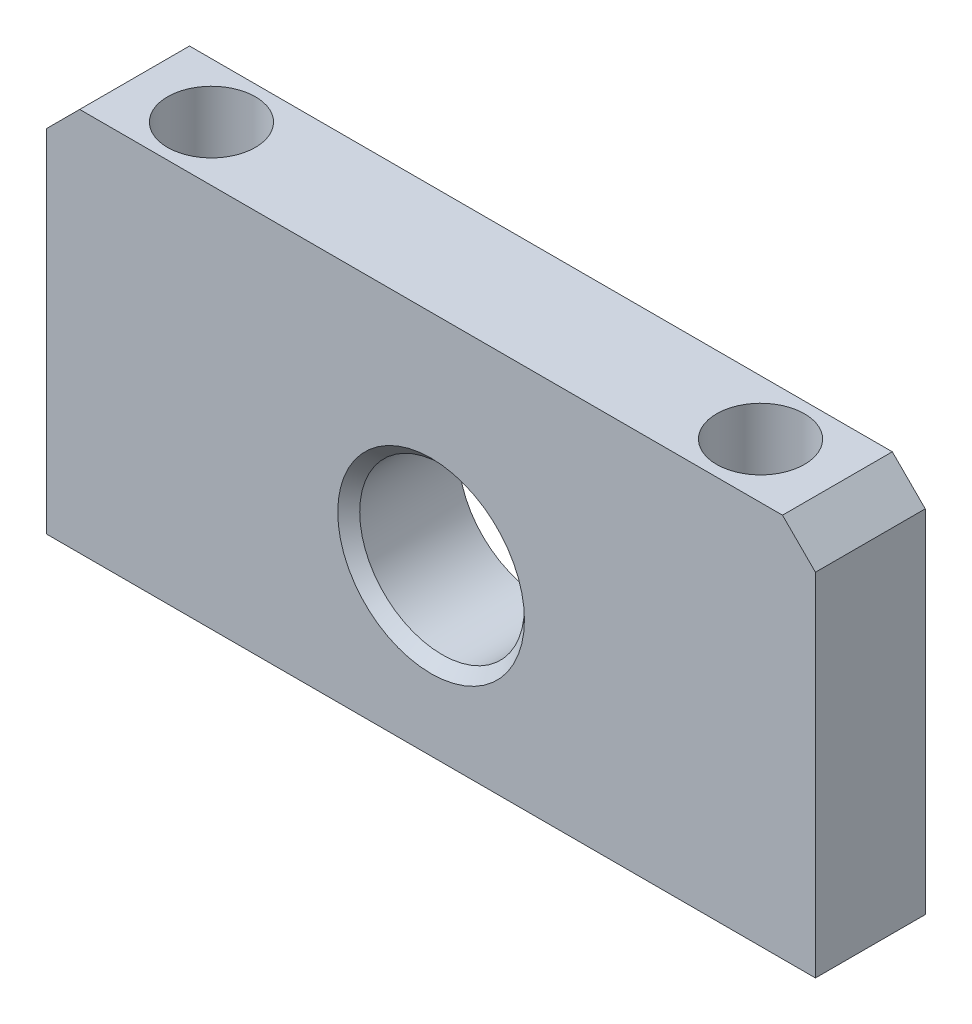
ISO-10303-21;
HEADER;
FILE_DESCRIPTION(('STEP AP214'),'2;1');
FILE_NAME('part.step','',(''),(''),'','','');
FILE_SCHEMA(('AUTOMOTIVE_DESIGN { 1 0 10303 214 1 1 1 1 }'));
ENDSEC;
DATA;
#1=APPLICATION_CONTEXT('core data for automotive mechanical design processes');
#2=APPLICATION_PROTOCOL_DEFINITION('international standard','automotive_design',2000,#1);
#3=PRODUCT_CONTEXT('',#1,'mechanical');
#4=PRODUCT('Part','Part','',(#3));
#5=PRODUCT_RELATED_PRODUCT_CATEGORY('part','',(#4));
#6=PRODUCT_DEFINITION_FORMATION('','',#4);
#7=PRODUCT_DEFINITION_CONTEXT('part definition',#1,'design');
#8=PRODUCT_DEFINITION('design','',#6,#7);
#9=PRODUCT_DEFINITION_SHAPE('','',#8);
#10=(LENGTH_UNIT() NAMED_UNIT(*) SI_UNIT(.MILLI.,.METRE.));
#11=(NAMED_UNIT(*) PLANE_ANGLE_UNIT() SI_UNIT($,.RADIAN.));
#12=(NAMED_UNIT(*) SI_UNIT($,.STERADIAN.) SOLID_ANGLE_UNIT());
#13=UNCERTAINTY_MEASURE_WITH_UNIT(LENGTH_MEASURE(1.E-05),#10,'distance_accuracy_value','');
#14=(GEOMETRIC_REPRESENTATION_CONTEXT(3) GLOBAL_UNCERTAINTY_ASSIGNED_CONTEXT((#13)) GLOBAL_UNIT_ASSIGNED_CONTEXT((#10,
#11,#12)) REPRESENTATION_CONTEXT('',''));
#15=CARTESIAN_POINT('',(0.,0.,0.));
#16=DIRECTION('',(0.,0.,1.));
#17=DIRECTION('',(1.,0.,0.));
#18=AXIS2_PLACEMENT_3D('',#15,#16,#17);
#19=CARTESIAN_POINT('',(0.,0.,10.));
#20=DIRECTION('',(1.,0.,0.));
#21=DIRECTION('',(0.,0.,-1.));
#22=AXIS2_PLACEMENT_3D('',#19,#20,#21);
#23=PLANE('',#22);
#24=DIRECTION('',(0.,-1.,0.));
#25=VECTOR('',#24,1.);
#26=CARTESIAN_POINT('',(0.,0.,10.));
#27=LINE('',#26,#25);
#28=CARTESIAN_POINT('',(0.,32.,10.));
#29=VERTEX_POINT('',#28);
#30=CARTESIAN_POINT('',(0.,0.,10.));
#31=VERTEX_POINT('',#30);
#32=EDGE_CURVE('E200',#29,#31,#27,.T.);
#33=ORIENTED_EDGE('',*,*,#32,.F.);
#34=DIRECTION('',(0.,0.,-1.));
#35=VECTOR('',#34,1.);
#36=CARTESIAN_POINT('',(0.,32.,10.));
#37=LINE('',#36,#35);
#38=CARTESIAN_POINT('',(0.,32.,0.));
#39=VERTEX_POINT('',#38);
#40=EDGE_CURVE('E87',#29,#39,#37,.T.);
#41=ORIENTED_EDGE('',*,*,#40,.T.);
#42=DIRECTION('',(0.,-1.,0.));
#43=VECTOR('',#42,1.);
#44=CARTESIAN_POINT('',(0.,0.,0.));
#45=LINE('',#44,#43);
#46=CARTESIAN_POINT('',(0.,0.,0.));
#47=VERTEX_POINT('',#46);
#48=EDGE_CURVE('E82',#39,#47,#45,.T.);
#49=ORIENTED_EDGE('',*,*,#48,.T.);
#50=DIRECTION('',(0.,0.,-1.));
#51=VECTOR('',#50,1.);
#52=CARTESIAN_POINT('',(0.,0.,10.));
#53=LINE('',#52,#51);
#54=EDGE_CURVE('E85',#31,#47,#53,.T.);
#55=ORIENTED_EDGE('',*,*,#54,.F.);
#56=EDGE_LOOP('',(#33,#41,#49,#55));
#57=FACE_BOUND('',#56,.T.);
#58=ADVANCED_FACE('F26',(#57),#23,.F.);
#59=CARTESIAN_POINT('',(0.,0.,10.));
#60=DIRECTION('',(0.,1.,0.));
#61=DIRECTION('',(0.,0.,1.));
#62=AXIS2_PLACEMENT_3D('',#59,#60,#61);
#63=PLANE('',#62);
#64=CARTESIAN_POINT('',(10.,0.,5.));
#65=DIRECTION('',(0.,1.,0.));
#66=DIRECTION('',(0.,0.,1.));
#67=AXIS2_PLACEMENT_3D('',#64,#65,#66);
#68=CIRCLE('',#67,2.5);
#69=CARTESIAN_POINT('',(10.,0.,7.5));
#70=VERTEX_POINT('',#69);
#71=EDGE_CURVE('E226',#70,#70,#68,.T.);
#72=ORIENTED_EDGE('',*,*,#71,.T.);
#73=EDGE_LOOP('',(#72));
#74=FACE_BOUND('',#73,.T.);
#75=CARTESIAN_POINT('',(60.,0.,5.));
#76=DIRECTION('',(0.,1.,0.));
#77=DIRECTION('',(0.,0.,1.));
#78=AXIS2_PLACEMENT_3D('',#75,#76,#77);
#79=CIRCLE('',#78,2.50000000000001);
#80=CARTESIAN_POINT('',(60.,0.,7.50000000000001));
#81=VERTEX_POINT('',#80);
#82=EDGE_CURVE('E220',#81,#81,#79,.T.);
#83=ORIENTED_EDGE('',*,*,#82,.T.);
#84=EDGE_LOOP('',(#83));
#85=FACE_BOUND('',#84,.T.);
#86=DIRECTION('',(1.,0.,0.));
#87=VECTOR('',#86,1.);
#88=CARTESIAN_POINT('',(0.,0.,0.));
#89=LINE('',#88,#87);
#90=CARTESIAN_POINT('',(70.,0.,0.));
#91=VERTEX_POINT('',#90);
#92=EDGE_CURVE('E89',#47,#91,#89,.T.);
#93=ORIENTED_EDGE('',*,*,#92,.T.);
#94=DIRECTION('',(0.,0.,-1.));
#95=VECTOR('',#94,1.);
#96=CARTESIAN_POINT('',(70.,0.,10.));
#97=LINE('',#96,#95);
#98=CARTESIAN_POINT('',(70.,0.,10.));
#99=VERTEX_POINT('',#98);
#100=EDGE_CURVE('E104',#99,#91,#97,.T.);
#101=ORIENTED_EDGE('',*,*,#100,.F.);
#102=DIRECTION('',(1.,0.,0.));
#103=VECTOR('',#102,1.);
#104=CARTESIAN_POINT('',(0.,0.,10.));
#105=LINE('',#104,#103);
#106=EDGE_CURVE('E102',#31,#99,#105,.T.);
#107=ORIENTED_EDGE('',*,*,#106,.F.);
#108=ORIENTED_EDGE('',*,*,#54,.T.);
#109=EDGE_LOOP('',(#93,#101,#107,#108));
#110=FACE_BOUND('',#109,.T.);
#111=ADVANCED_FACE('F101',(#74,#85,#110),#63,.F.);
#112=CARTESIAN_POINT('',(70.,0.,10.));
#113=DIRECTION('',(-1.,0.,0.));
#114=DIRECTION('',(0.,0.,1.));
#115=AXIS2_PLACEMENT_3D('',#112,#113,#114);
#116=PLANE('',#115);
#117=DIRECTION('',(0.,1.,0.));
#118=VECTOR('',#117,1.);
#119=CARTESIAN_POINT('',(70.,0.,0.));
#120=LINE('',#119,#118);
#121=CARTESIAN_POINT('',(70.,32.,0.));
#122=VERTEX_POINT('',#121);
#123=EDGE_CURVE('E95',#91,#122,#120,.T.);
#124=ORIENTED_EDGE('',*,*,#123,.T.);
#125=DIRECTION('',(0.,0.,1.));
#126=VECTOR('',#125,1.);
#127=CARTESIAN_POINT('',(70.,32.,10.));
#128=LINE('',#127,#126);
#129=CARTESIAN_POINT('',(70.,32.,10.));
#130=VERTEX_POINT('',#129);
#131=EDGE_CURVE('E48',#122,#130,#128,.T.);
#132=ORIENTED_EDGE('',*,*,#131,.T.);
#133=DIRECTION('',(0.,1.,0.));
#134=VECTOR('',#133,1.);
#135=CARTESIAN_POINT('',(70.,0.,10.));
#136=LINE('',#135,#134);
#137=EDGE_CURVE('E206',#99,#130,#136,.T.);
#138=ORIENTED_EDGE('',*,*,#137,.F.);
#139=ORIENTED_EDGE('',*,*,#100,.T.);
#140=EDGE_LOOP('',(#124,#132,#138,#139));
#141=FACE_BOUND('',#140,.T.);
#142=ADVANCED_FACE('F142',(#141),#116,.F.);
#143=CARTESIAN_POINT('',(0.,35.,10.));
#144=DIRECTION('',(0.,-1.,0.));
#145=DIRECTION('',(0.,0.,-1.));
#146=AXIS2_PLACEMENT_3D('',#143,#144,#145);
#147=PLANE('',#146);
#148=CARTESIAN_POINT('',(10.,35.,5.));
#149=DIRECTION('',(0.,1.,0.));
#150=DIRECTION('',(0.,0.,1.));
#151=AXIS2_PLACEMENT_3D('',#148,#149,#150);
#152=CIRCLE('',#151,4.);
#153=CARTESIAN_POINT('',(10.,35.,9.));
#154=VERTEX_POINT('',#153);
#155=EDGE_CURVE('E217',#154,#154,#152,.T.);
#156=ORIENTED_EDGE('',*,*,#155,.F.);
#157=EDGE_LOOP('',(#156));
#158=FACE_BOUND('',#157,.T.);
#159=CARTESIAN_POINT('',(60.,35.,5.));
#160=DIRECTION('',(0.,1.,0.));
#161=DIRECTION('',(0.,0.,1.));
#162=AXIS2_PLACEMENT_3D('',#159,#160,#161);
#163=CIRCLE('',#162,4.00000000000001);
#164=CARTESIAN_POINT('',(60.,35.,9.00000000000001));
#165=VERTEX_POINT('',#164);
#166=EDGE_CURVE('E211',#165,#165,#163,.T.);
#167=ORIENTED_EDGE('',*,*,#166,.F.);
#168=EDGE_LOOP('',(#167));
#169=FACE_BOUND('',#168,.T.);
#170=DIRECTION('',(-1.,0.,0.));
#171=VECTOR('',#170,1.);
#172=CARTESIAN_POINT('',(0.,35.,10.));
#173=LINE('',#172,#171);
#174=CARTESIAN_POINT('',(67.,35.,10.));
#175=VERTEX_POINT('',#174);
#176=CARTESIAN_POINT('',(3.00000000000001,35.,10.));
#177=VERTEX_POINT('',#176);
#178=EDGE_CURVE('E108',#175,#177,#173,.T.);
#179=ORIENTED_EDGE('',*,*,#178,.F.);
#180=DIRECTION('',(0.,0.,-1.));
#181=VECTOR('',#180,1.);
#182=CARTESIAN_POINT('',(67.,35.,10.));
#183=LINE('',#182,#181);
#184=CARTESIAN_POINT('',(67.,35.,0.));
#185=VERTEX_POINT('',#184);
#186=EDGE_CURVE('E106',#175,#185,#183,.T.);
#187=ORIENTED_EDGE('',*,*,#186,.T.);
#188=DIRECTION('',(-1.,0.,0.));
#189=VECTOR('',#188,1.);
#190=CARTESIAN_POINT('',(0.,35.,0.));
#191=LINE('',#190,#189);
#192=CARTESIAN_POINT('',(3.00000000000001,35.,0.));
#193=VERTEX_POINT('',#192);
#194=EDGE_CURVE('E196',#185,#193,#191,.T.);
#195=ORIENTED_EDGE('',*,*,#194,.T.);
#196=DIRECTION('',(0.,0.,1.));
#197=VECTOR('',#196,1.);
#198=CARTESIAN_POINT('',(3.00000000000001,35.,10.));
#199=LINE('',#198,#197);
#200=EDGE_CURVE('E103',#193,#177,#199,.T.);
#201=ORIENTED_EDGE('',*,*,#200,.T.);
#202=EDGE_LOOP('',(#179,#187,#195,#201));
#203=FACE_BOUND('',#202,.T.);
#204=ADVANCED_FACE('F147',(#158,#169,#203),#147,.F.);
#205=CARTESIAN_POINT('',(0.,35.,10.));
#206=DIRECTION('',(0.,0.,-1.));
#207=DIRECTION('',(-1.,0.,0.));
#208=AXIS2_PLACEMENT_3D('',#205,#206,#207);
#209=PLANE('',#208);
#210=CARTESIAN_POINT('',(35.,15.,10.));
#211=DIRECTION('',(0.,0.,-1.));
#212=DIRECTION('',(-1.,0.,0.));
#213=AXIS2_PLACEMENT_3D('',#210,#211,#212);
#214=CIRCLE('',#213,8.50000000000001);
#215=CARTESIAN_POINT('',(26.5,15.,10.));
#216=VERTEX_POINT('',#215);
#217=EDGE_CURVE('E11',#216,#216,#214,.T.);
#218=ORIENTED_EDGE('',*,*,#217,.T.);
#219=EDGE_LOOP('',(#218));
#220=FACE_BOUND('',#219,.T.);
#221=ORIENTED_EDGE('',*,*,#137,.T.);
#222=DIRECTION('',(0.707106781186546,-0.707106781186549,0.));
#223=VECTOR('',#222,1.);
#224=CARTESIAN_POINT('',(67.,35.,10.));
#225=LINE('',#224,#223);
#226=EDGE_CURVE('E120',#130,#175,#225,.F.);
#227=ORIENTED_EDGE('',*,*,#226,.T.);
#228=ORIENTED_EDGE('',*,*,#178,.T.);
#229=DIRECTION('',(0.70710678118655,0.707106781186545,0.));
#230=VECTOR('',#229,1.);
#231=CARTESIAN_POINT('',(0.,32.,10.));
#232=LINE('',#231,#230);
#233=EDGE_CURVE('E40',#177,#29,#232,.F.);
#234=ORIENTED_EDGE('',*,*,#233,.T.);
#235=ORIENTED_EDGE('',*,*,#32,.T.);
#236=ORIENTED_EDGE('',*,*,#106,.T.);
#237=EDGE_LOOP('',(#221,#227,#228,#234,#235,#236));
#238=FACE_BOUND('',#237,.T.);
#239=ADVANCED_FACE('F154',(#220,#238),#209,.F.);
#240=CARTESIAN_POINT('',(0.,35.,0.));
#241=DIRECTION('',(0.,0.,-1.));
#242=DIRECTION('',(-1.,0.,0.));
#243=AXIS2_PLACEMENT_3D('',#240,#241,#242);
#244=PLANE('',#243);
#245=CARTESIAN_POINT('',(35.,15.,0.));
#246=DIRECTION('',(0.,0.,1.));
#247=DIRECTION('',(1.,0.,0.));
#248=AXIS2_PLACEMENT_3D('',#245,#246,#247);
#249=CIRCLE('',#248,7.5);
#250=CARTESIAN_POINT('',(42.5,15.,0.));
#251=VERTEX_POINT('',#250);
#252=EDGE_CURVE('E231',#251,#251,#249,.T.);
#253=ORIENTED_EDGE('',*,*,#252,.T.);
#254=EDGE_LOOP('',(#253));
#255=FACE_BOUND('',#254,.T.);
#256=ORIENTED_EDGE('',*,*,#194,.F.);
#257=DIRECTION('',(-0.707106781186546,0.707106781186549,0.));
#258=VECTOR('',#257,1.);
#259=CARTESIAN_POINT('',(33.5000000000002,68.5,0.));
#260=LINE('',#259,#258);
#261=EDGE_CURVE('E116',#185,#122,#260,.F.);
#262=ORIENTED_EDGE('',*,*,#261,.T.);
#263=ORIENTED_EDGE('',*,*,#123,.F.);
#264=ORIENTED_EDGE('',*,*,#92,.F.);
#265=ORIENTED_EDGE('',*,*,#48,.F.);
#266=DIRECTION('',(-0.70710678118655,-0.707106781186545,0.));
#267=VECTOR('',#266,1.);
#268=CARTESIAN_POINT('',(1.5,33.5,0.));
#269=LINE('',#268,#267);
#270=EDGE_CURVE('E114',#39,#193,#269,.F.);
#271=ORIENTED_EDGE('',*,*,#270,.T.);
#272=EDGE_LOOP('',(#256,#262,#263,#264,#265,#271));
#273=FACE_BOUND('',#272,.T.);
#274=ADVANCED_FACE('F94',(#255,#273),#244,.T.);
#275=CARTESIAN_POINT('',(60.,25.,5.));
#276=DIRECTION('',(0.,1.,0.));
#277=DIRECTION('',(0.,0.,1.));
#278=AXIS2_PLACEMENT_3D('',#275,#276,#277);
#279=CYLINDRICAL_SURFACE('',#278,4.00000000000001);
#280=CARTESIAN_POINT('',(60.,25.,5.));
#281=DIRECTION('',(0.,1.,0.));
#282=DIRECTION('',(0.,0.,1.));
#283=AXIS2_PLACEMENT_3D('',#280,#281,#282);
#284=CIRCLE('',#283,4.00000000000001);
#285=CARTESIAN_POINT('',(60.,25.,9.00000000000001));
#286=VERTEX_POINT('',#285);
#287=EDGE_CURVE('E90',#286,#286,#284,.T.);
#288=ORIENTED_EDGE('',*,*,#287,.F.);
#289=EDGE_LOOP('',(#288));
#290=FACE_BOUND('',#289,.T.);
#291=ORIENTED_EDGE('',*,*,#166,.T.);
#292=EDGE_LOOP('',(#291));
#293=FACE_BOUND('',#292,.T.);
#294=ADVANCED_FACE('F161',(#290,#293),#279,.F.);
#295=CARTESIAN_POINT('',(60.,25.,5.));
#296=DIRECTION('',(0.,1.,0.));
#297=DIRECTION('',(0.,0.,1.));
#298=AXIS2_PLACEMENT_3D('',#295,#296,#297);
#299=PLANE('',#298);
#300=CARTESIAN_POINT('',(60.,25.,5.));
#301=DIRECTION('',(0.,1.,0.));
#302=DIRECTION('',(0.,0.,1.));
#303=AXIS2_PLACEMENT_3D('',#300,#301,#302);
#304=CIRCLE('',#303,2.50000000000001);
#305=CARTESIAN_POINT('',(60.,25.,7.50000000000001));
#306=VERTEX_POINT('',#305);
#307=EDGE_CURVE('E223',#306,#306,#304,.T.);
#308=ORIENTED_EDGE('',*,*,#307,.F.);
#309=EDGE_LOOP('',(#308));
#310=FACE_BOUND('',#309,.T.);
#311=ORIENTED_EDGE('',*,*,#287,.T.);
#312=EDGE_LOOP('',(#311));
#313=FACE_BOUND('',#312,.T.);
#314=ADVANCED_FACE('F165',(#310,#313),#299,.T.);
#315=CARTESIAN_POINT('',(10.,25.,5.));
#316=DIRECTION('',(0.,1.,0.));
#317=DIRECTION('',(0.,0.,1.));
#318=AXIS2_PLACEMENT_3D('',#315,#316,#317);
#319=CYLINDRICAL_SURFACE('',#318,4.);
#320=CARTESIAN_POINT('',(10.,25.,5.));
#321=DIRECTION('',(0.,1.,0.));
#322=DIRECTION('',(0.,0.,1.));
#323=AXIS2_PLACEMENT_3D('',#320,#321,#322);
#324=CIRCLE('',#323,4.);
#325=CARTESIAN_POINT('',(10.,25.,9.));
#326=VERTEX_POINT('',#325);
#327=EDGE_CURVE('E214',#326,#326,#324,.T.);
#328=ORIENTED_EDGE('',*,*,#327,.F.);
#329=EDGE_LOOP('',(#328));
#330=FACE_BOUND('',#329,.T.);
#331=ORIENTED_EDGE('',*,*,#155,.T.);
#332=EDGE_LOOP('',(#331));
#333=FACE_BOUND('',#332,.T.);
#334=ADVANCED_FACE('F169',(#330,#333),#319,.F.);
#335=CARTESIAN_POINT('',(10.,25.,5.));
#336=DIRECTION('',(0.,1.,0.));
#337=DIRECTION('',(0.,0.,1.));
#338=AXIS2_PLACEMENT_3D('',#335,#336,#337);
#339=PLANE('',#338);
#340=CARTESIAN_POINT('',(10.,25.,5.));
#341=DIRECTION('',(0.,1.,0.));
#342=DIRECTION('',(0.,0.,1.));
#343=AXIS2_PLACEMENT_3D('',#340,#341,#342);
#344=CIRCLE('',#343,2.5);
#345=CARTESIAN_POINT('',(10.,25.,7.5));
#346=VERTEX_POINT('',#345);
#347=EDGE_CURVE('E228',#346,#346,#344,.T.);
#348=ORIENTED_EDGE('',*,*,#347,.F.);
#349=EDGE_LOOP('',(#348));
#350=FACE_BOUND('',#349,.T.);
#351=ORIENTED_EDGE('',*,*,#327,.T.);
#352=EDGE_LOOP('',(#351));
#353=FACE_BOUND('',#352,.T.);
#354=ADVANCED_FACE('F173',(#350,#353),#339,.T.);
#355=CARTESIAN_POINT('',(60.,0.,5.));
#356=DIRECTION('',(0.,1.,0.));
#357=DIRECTION('',(0.,0.,1.));
#358=AXIS2_PLACEMENT_3D('',#355,#356,#357);
#359=CYLINDRICAL_SURFACE('',#358,2.50000000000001);
#360=ORIENTED_EDGE('',*,*,#82,.F.);
#361=EDGE_LOOP('',(#360));
#362=FACE_BOUND('',#361,.T.);
#363=ORIENTED_EDGE('',*,*,#307,.T.);
#364=EDGE_LOOP('',(#363));
#365=FACE_BOUND('',#364,.T.);
#366=ADVANCED_FACE('F177',(#362,#365),#359,.F.);
#367=CARTESIAN_POINT('',(10.,0.,5.));
#368=DIRECTION('',(0.,1.,0.));
#369=DIRECTION('',(0.,0.,1.));
#370=AXIS2_PLACEMENT_3D('',#367,#368,#369);
#371=CYLINDRICAL_SURFACE('',#370,2.5);
#372=ORIENTED_EDGE('',*,*,#71,.F.);
#373=EDGE_LOOP('',(#372));
#374=FACE_BOUND('',#373,.T.);
#375=ORIENTED_EDGE('',*,*,#347,.T.);
#376=EDGE_LOOP('',(#375));
#377=FACE_BOUND('',#376,.T.);
#378=ADVANCED_FACE('F181',(#374,#377),#371,.F.);
#379=CARTESIAN_POINT('',(67.,35.,10.));
#380=DIRECTION('',(-0.707106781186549,-0.707106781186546,0.));
#381=DIRECTION('',(0.707106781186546,-0.707106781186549,0.));
#382=AXIS2_PLACEMENT_3D('',#379,#380,#381);
#383=PLANE('',#382);
#384=ORIENTED_EDGE('',*,*,#226,.F.);
#385=ORIENTED_EDGE('',*,*,#131,.F.);
#386=ORIENTED_EDGE('',*,*,#261,.F.);
#387=ORIENTED_EDGE('',*,*,#186,.F.);
#388=EDGE_LOOP('',(#384,#385,#386,#387));
#389=FACE_BOUND('',#388,.T.);
#390=ADVANCED_FACE('F185',(#389),#383,.F.);
#391=CARTESIAN_POINT('',(0.,32.,10.));
#392=DIRECTION('',(0.707106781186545,-0.70710678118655,0.));
#393=DIRECTION('',(0.70710678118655,0.707106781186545,0.));
#394=AXIS2_PLACEMENT_3D('',#391,#392,#393);
#395=PLANE('',#394);
#396=ORIENTED_EDGE('',*,*,#233,.F.);
#397=ORIENTED_EDGE('',*,*,#200,.F.);
#398=ORIENTED_EDGE('',*,*,#270,.F.);
#399=ORIENTED_EDGE('',*,*,#40,.F.);
#400=EDGE_LOOP('',(#396,#397,#398,#399));
#401=FACE_BOUND('',#400,.T.);
#402=ADVANCED_FACE('F135',(#401),#395,.F.);
#403=CARTESIAN_POINT('',(35.,15.,0.));
#404=DIRECTION('',(0.,0.,1.));
#405=DIRECTION('',(1.,0.,0.));
#406=AXIS2_PLACEMENT_3D('',#403,#404,#405);
#407=CYLINDRICAL_SURFACE('',#406,7.5);
#408=CARTESIAN_POINT('',(35.,15.,9.));
#409=DIRECTION('',(0.,0.,-1.));
#410=DIRECTION('',(-1.,0.,0.));
#411=AXIS2_PLACEMENT_3D('',#408,#409,#410);
#412=CIRCLE('',#411,7.5);
#413=CARTESIAN_POINT('',(27.5,15.,9.));
#414=VERTEX_POINT('',#413);
#415=EDGE_CURVE('E33',#414,#414,#412,.F.);
#416=ORIENTED_EDGE('',*,*,#415,.T.);
#417=EDGE_LOOP('',(#416));
#418=FACE_BOUND('',#417,.T.);
#419=ORIENTED_EDGE('',*,*,#252,.F.);
#420=EDGE_LOOP('',(#419));
#421=FACE_BOUND('',#420,.T.);
#422=ADVANCED_FACE('F125',(#418,#421),#407,.F.);
#423=CARTESIAN_POINT('',(35.,15.,9.));
#424=DIRECTION('',(0.,0.,1.));
#425=DIRECTION('',(1.,0.,0.));
#426=AXIS2_PLACEMENT_3D('',#423,#424,#425);
#427=CONICAL_SURFACE('',#426,7.5,0.785398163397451);
#428=ORIENTED_EDGE('',*,*,#217,.F.);
#429=EDGE_LOOP('',(#428));
#430=FACE_BOUND('',#429,.T.);
#431=ORIENTED_EDGE('',*,*,#415,.F.);
#432=EDGE_LOOP('',(#431));
#433=FACE_BOUND('',#432,.T.);
#434=ADVANCED_FACE('F128',(#430,#433),#427,.F.);
#435=CLOSED_SHELL('',(#58,#111,#142,#204,#239,#274,#294,#314,#334,#354,#366,#378,#390,#402,#422,#434));
#436=MANIFOLD_SOLID_BREP('B2',#435);
#437=ADVANCED_BREP_SHAPE_REPRESENTATION('',(#18,#436),#14);
#438=SHAPE_DEFINITION_REPRESENTATION(#9,#437);
ENDSEC;
END-ISO-10303-21;
